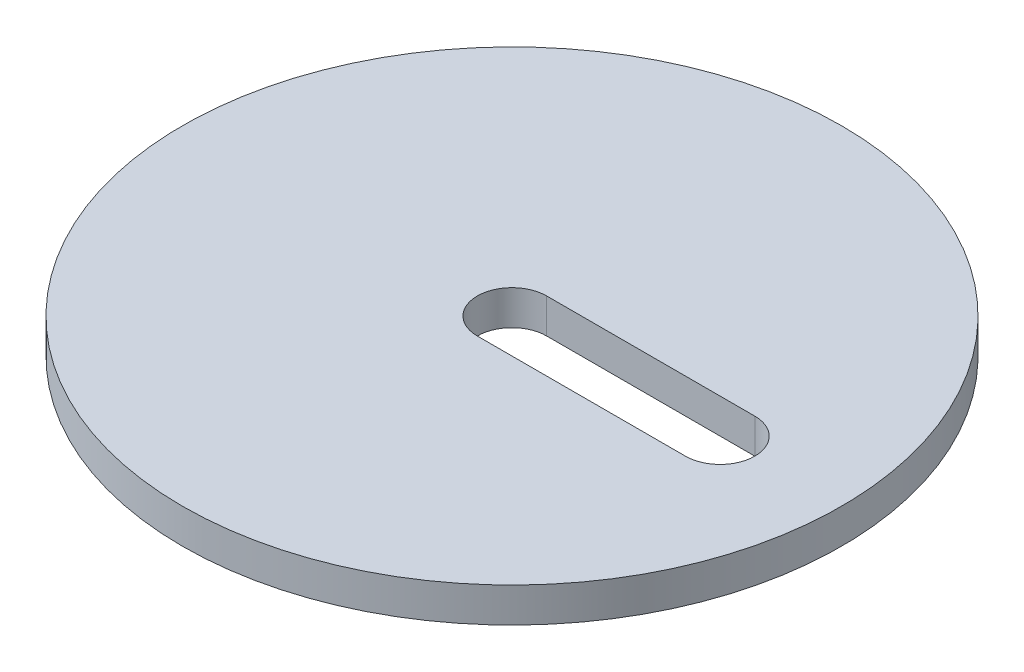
from build123d import *

# Parameters (mm, degrees)
SKETCH1_R           = 30.1625
BOSS_EXTRUDE1_DEPTH = 3.175


with BuildPart() as part:
    # Sketch1 → Boss-Extrude1 (new body)
    with BuildSketch(Plane(origin=(0, 0, 0), x_dir=(1, 0, 0), z_dir=(0, 1, 0))):
        with Locations(Location((0, 0, 0), (0, 0, 270))):
            Circle(SKETCH1_R)
        with BuildLine():
            Line((0, 3.175), (19.05, 3.175))
            ThreePointArc((19.05, 3.175), (22.225, 0), (19.05, -3.175))
            Line((19.05, -3.175), (0, -3.175))
            ThreePointArc((0, -3.175), (-3.175, 0), (0, 3.175))
        make_face(mode=Mode.SUBTRACT)
    extrude(amount=BOSS_EXTRUDE1_DEPTH)


solid = part.part
